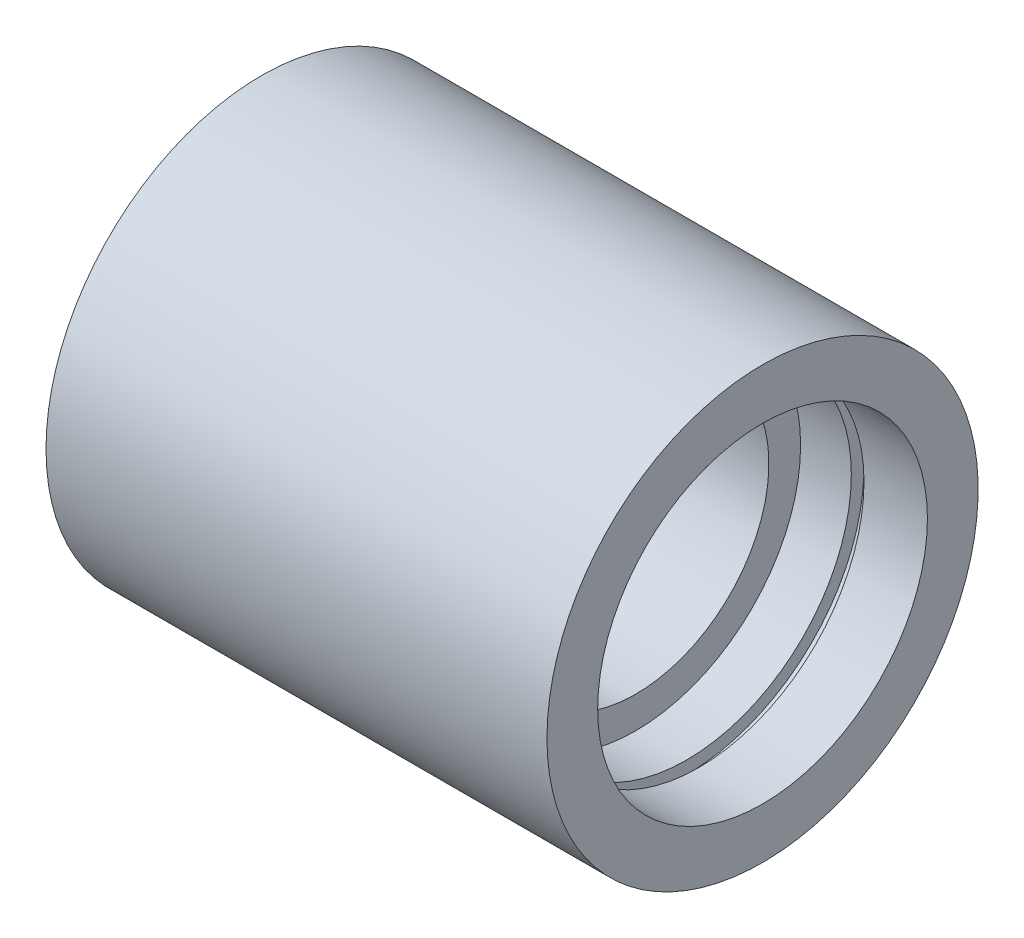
ISO-10303-21;
HEADER;
FILE_DESCRIPTION(('STEP AP214'),'2;1');
FILE_NAME('part.step','',(''),(''),'','','');
FILE_SCHEMA(('AUTOMOTIVE_DESIGN { 1 0 10303 214 1 1 1 1 }'));
ENDSEC;
DATA;
#1=APPLICATION_CONTEXT('core data for automotive mechanical design processes');
#2=APPLICATION_PROTOCOL_DEFINITION('international standard','automotive_design',2000,#1);
#3=PRODUCT_CONTEXT('',#1,'mechanical');
#4=PRODUCT('Part','Part','',(#3));
#5=PRODUCT_RELATED_PRODUCT_CATEGORY('part','',(#4));
#6=PRODUCT_DEFINITION_FORMATION('','',#4);
#7=PRODUCT_DEFINITION_CONTEXT('part definition',#1,'design');
#8=PRODUCT_DEFINITION('design','',#6,#7);
#9=PRODUCT_DEFINITION_SHAPE('','',#8);
#10=(LENGTH_UNIT() NAMED_UNIT(*) SI_UNIT(.MILLI.,.METRE.));
#11=(NAMED_UNIT(*) PLANE_ANGLE_UNIT() SI_UNIT($,.RADIAN.));
#12=(NAMED_UNIT(*) SI_UNIT($,.STERADIAN.) SOLID_ANGLE_UNIT());
#13=UNCERTAINTY_MEASURE_WITH_UNIT(LENGTH_MEASURE(1.E-05),#10,'distance_accuracy_value','');
#14=(GEOMETRIC_REPRESENTATION_CONTEXT(3) GLOBAL_UNCERTAINTY_ASSIGNED_CONTEXT((#13)) GLOBAL_UNIT_ASSIGNED_CONTEXT((#10,
#11,#12)) REPRESENTATION_CONTEXT('',''));
#15=CARTESIAN_POINT('',(0.,0.,0.));
#16=DIRECTION('',(0.,0.,1.));
#17=DIRECTION('',(1.,0.,0.));
#18=AXIS2_PLACEMENT_3D('',#15,#16,#17);
#19=CARTESIAN_POINT('',(0.,0.,0.));
#20=DIRECTION('',(-1.,0.,0.));
#21=DIRECTION('',(0.,0.,1.));
#22=AXIS2_PLACEMENT_3D('',#19,#20,#21);
#23=CYLINDRICAL_SURFACE('',#22,13.);
#24=CARTESIAN_POINT('',(10.,0.,0.));
#25=DIRECTION('',(-1.,0.,0.));
#26=DIRECTION('',(0.,0.,1.));
#27=AXIS2_PLACEMENT_3D('',#24,#25,#26);
#28=CIRCLE('',#27,13.);
#29=CARTESIAN_POINT('',(10.,0.,13.));
#30=VERTEX_POINT('',#29);
#31=EDGE_CURVE('E10',#30,#30,#28,.T.);
#32=ORIENTED_EDGE('',*,*,#31,.F.);
#33=EDGE_LOOP('',(#32));
#34=FACE_BOUND('',#33,.T.);
#35=CARTESIAN_POINT('',(0.,0.,0.));
#36=DIRECTION('',(-1.,0.,0.));
#37=DIRECTION('',(0.,0.,1.));
#38=AXIS2_PLACEMENT_3D('',#35,#36,#37);
#39=CIRCLE('',#38,13.);
#40=CARTESIAN_POINT('',(0.,0.,13.));
#41=VERTEX_POINT('',#40);
#42=EDGE_CURVE('E392',#41,#41,#39,.T.);
#43=ORIENTED_EDGE('',*,*,#42,.T.);
#44=EDGE_LOOP('',(#43));
#45=FACE_BOUND('',#44,.T.);
#46=ADVANCED_FACE('F346',(#34,#45),#23,.F.);
#47=CARTESIAN_POINT('',(10.,4.,0.));
#48=DIRECTION('',(1.,0.,0.));
#49=DIRECTION('',(0.,0.,-1.));
#50=AXIS2_PLACEMENT_3D('',#47,#48,#49);
#51=PLANE('',#50);
#52=CARTESIAN_POINT('',(10.,0.,0.));
#53=DIRECTION('',(-1.,0.,0.));
#54=DIRECTION('',(0.,0.,1.));
#55=AXIS2_PLACEMENT_3D('',#52,#53,#54);
#56=CIRCLE('',#55,4.);
#57=CARTESIAN_POINT('',(10.,0.,4.));
#58=VERTEX_POINT('',#57);
#59=EDGE_CURVE('E352',#58,#58,#56,.T.);
#60=ORIENTED_EDGE('',*,*,#59,.F.);
#61=EDGE_LOOP('',(#60));
#62=FACE_BOUND('',#61,.T.);
#63=ORIENTED_EDGE('',*,*,#31,.T.);
#64=EDGE_LOOP('',(#63));
#65=FACE_BOUND('',#64,.T.);
#66=ADVANCED_FACE('F465',(#62,#65),#51,.F.);
#67=CARTESIAN_POINT('',(0.,0.,0.));
#68=DIRECTION('',(-1.,0.,0.));
#69=DIRECTION('',(0.,0.,1.));
#70=AXIS2_PLACEMENT_3D('',#67,#68,#69);
#71=CYLINDRICAL_SURFACE('',#70,4.);
#72=CARTESIAN_POINT('',(15.,0.,0.));
#73=DIRECTION('',(-1.,0.,0.));
#74=DIRECTION('',(0.,0.,1.));
#75=AXIS2_PLACEMENT_3D('',#72,#73,#74);
#76=CIRCLE('',#75,4.);
#77=CARTESIAN_POINT('',(15.,0.,4.));
#78=VERTEX_POINT('',#77);
#79=EDGE_CURVE('E356',#78,#78,#76,.T.);
#80=ORIENTED_EDGE('',*,*,#79,.F.);
#81=EDGE_LOOP('',(#80));
#82=FACE_BOUND('',#81,.T.);
#83=ORIENTED_EDGE('',*,*,#59,.T.);
#84=EDGE_LOOP('',(#83));
#85=FACE_BOUND('',#84,.T.);
#86=ADVANCED_FACE('F460',(#82,#85),#71,.F.);
#87=CARTESIAN_POINT('',(15.,10.5,0.));
#88=DIRECTION('',(-1.,0.,0.));
#89=DIRECTION('',(0.,0.,1.));
#90=AXIS2_PLACEMENT_3D('',#87,#88,#89);
#91=PLANE('',#90);
#92=CARTESIAN_POINT('',(15.,0.,0.));
#93=DIRECTION('',(-1.,0.,0.));
#94=DIRECTION('',(0.,0.,1.));
#95=AXIS2_PLACEMENT_3D('',#92,#93,#94);
#96=CIRCLE('',#95,10.5);
#97=CARTESIAN_POINT('',(15.,0.,10.5));
#98=VERTEX_POINT('',#97);
#99=EDGE_CURVE('E360',#98,#98,#96,.T.);
#100=ORIENTED_EDGE('',*,*,#99,.F.);
#101=EDGE_LOOP('',(#100));
#102=FACE_BOUND('',#101,.T.);
#103=ORIENTED_EDGE('',*,*,#79,.T.);
#104=EDGE_LOOP('',(#103));
#105=FACE_BOUND('',#104,.T.);
#106=ADVANCED_FACE('F454',(#102,#105),#91,.F.);
#107=CARTESIAN_POINT('',(0.,0.,0.));
#108=DIRECTION('',(-1.,0.,0.));
#109=DIRECTION('',(0.,0.,1.));
#110=AXIS2_PLACEMENT_3D('',#107,#108,#109);
#111=CYLINDRICAL_SURFACE('',#110,10.5);
#112=CARTESIAN_POINT('',(29.5,0.,0.));
#113=DIRECTION('',(-1.,0.,0.));
#114=DIRECTION('',(0.,0.,1.));
#115=AXIS2_PLACEMENT_3D('',#112,#113,#114);
#116=CIRCLE('',#115,10.5);
#117=CARTESIAN_POINT('',(29.5,0.,10.5));
#118=VERTEX_POINT('',#117);
#119=EDGE_CURVE('E365',#118,#118,#116,.T.);
#120=ORIENTED_EDGE('',*,*,#119,.F.);
#121=EDGE_LOOP('',(#120));
#122=FACE_BOUND('',#121,.T.);
#123=ORIENTED_EDGE('',*,*,#99,.T.);
#124=EDGE_LOOP('',(#123));
#125=FACE_BOUND('',#124,.T.);
#126=ADVANCED_FACE('F448',(#122,#125),#111,.F.);
#127=CARTESIAN_POINT('',(29.5,13.,0.));
#128=DIRECTION('',(-1.,0.,0.));
#129=DIRECTION('',(0.,0.,1.));
#130=AXIS2_PLACEMENT_3D('',#127,#128,#129);
#131=PLANE('',#130);
#132=CARTESIAN_POINT('',(29.5,0.,0.));
#133=DIRECTION('',(-1.,0.,0.));
#134=DIRECTION('',(0.,0.,1.));
#135=AXIS2_PLACEMENT_3D('',#132,#133,#134);
#136=CIRCLE('',#135,13.);
#137=CARTESIAN_POINT('',(29.5,0.,13.));
#138=VERTEX_POINT('',#137);
#139=EDGE_CURVE('E368',#138,#138,#136,.T.);
#140=ORIENTED_EDGE('',*,*,#139,.F.);
#141=EDGE_LOOP('',(#140));
#142=FACE_BOUND('',#141,.T.);
#143=ORIENTED_EDGE('',*,*,#119,.T.);
#144=EDGE_LOOP('',(#143));
#145=FACE_BOUND('',#144,.T.);
#146=ADVANCED_FACE('F442',(#142,#145),#131,.F.);
#147=CARTESIAN_POINT('',(0.,0.,0.));
#148=DIRECTION('',(-1.,0.,0.));
#149=DIRECTION('',(0.,0.,1.));
#150=AXIS2_PLACEMENT_3D('',#147,#148,#149);
#151=CYLINDRICAL_SURFACE('',#150,13.);
#152=CARTESIAN_POINT('',(33.5,0.,0.));
#153=DIRECTION('',(-1.,0.,0.));
#154=DIRECTION('',(0.,0.,1.));
#155=AXIS2_PLACEMENT_3D('',#152,#153,#154);
#156=CIRCLE('',#155,13.);
#157=CARTESIAN_POINT('',(33.5,0.,13.));
#158=VERTEX_POINT('',#157);
#159=EDGE_CURVE('E371',#158,#158,#156,.T.);
#160=ORIENTED_EDGE('',*,*,#159,.F.);
#161=EDGE_LOOP('',(#160));
#162=FACE_BOUND('',#161,.T.);
#163=ORIENTED_EDGE('',*,*,#139,.T.);
#164=EDGE_LOOP('',(#163));
#165=FACE_BOUND('',#164,.T.);
#166=ADVANCED_FACE('F436',(#162,#165),#151,.F.);
#167=CARTESIAN_POINT('',(33.5,14.,0.));
#168=DIRECTION('',(-1.,0.,0.));
#169=DIRECTION('',(0.,0.,1.));
#170=AXIS2_PLACEMENT_3D('',#167,#168,#169);
#171=PLANE('',#170);
#172=CARTESIAN_POINT('',(33.5,0.,0.));
#173=DIRECTION('',(-1.,0.,0.));
#174=DIRECTION('',(0.,0.,1.));
#175=AXIS2_PLACEMENT_3D('',#172,#173,#174);
#176=CIRCLE('',#175,14.);
#177=CARTESIAN_POINT('',(33.5,0.,14.));
#178=VERTEX_POINT('',#177);
#179=EDGE_CURVE('E374',#178,#178,#176,.T.);
#180=ORIENTED_EDGE('',*,*,#179,.F.);
#181=EDGE_LOOP('',(#180));
#182=FACE_BOUND('',#181,.T.);
#183=ORIENTED_EDGE('',*,*,#159,.T.);
#184=EDGE_LOOP('',(#183));
#185=FACE_BOUND('',#184,.T.);
#186=ADVANCED_FACE('F430',(#182,#185),#171,.F.);
#187=CARTESIAN_POINT('',(0.,0.,0.));
#188=DIRECTION('',(-1.,0.,0.));
#189=DIRECTION('',(0.,0.,1.));
#190=AXIS2_PLACEMENT_3D('',#187,#188,#189);
#191=CYLINDRICAL_SURFACE('',#190,14.);
#192=CARTESIAN_POINT('',(34.5,0.,0.));
#193=DIRECTION('',(-1.,0.,0.));
#194=DIRECTION('',(0.,0.,1.));
#195=AXIS2_PLACEMENT_3D('',#192,#193,#194);
#196=CIRCLE('',#195,14.);
#197=CARTESIAN_POINT('',(34.5,0.,14.));
#198=VERTEX_POINT('',#197);
#199=EDGE_CURVE('E377',#198,#198,#196,.T.);
#200=ORIENTED_EDGE('',*,*,#199,.F.);
#201=EDGE_LOOP('',(#200));
#202=FACE_BOUND('',#201,.T.);
#203=ORIENTED_EDGE('',*,*,#179,.T.);
#204=EDGE_LOOP('',(#203));
#205=FACE_BOUND('',#204,.T.);
#206=ADVANCED_FACE('F424',(#202,#205),#191,.F.);
#207=CARTESIAN_POINT('',(34.5,13.,0.));
#208=DIRECTION('',(1.,0.,0.));
#209=DIRECTION('',(0.,0.,-1.));
#210=AXIS2_PLACEMENT_3D('',#207,#208,#209);
#211=PLANE('',#210);
#212=CARTESIAN_POINT('',(34.5,0.,0.));
#213=DIRECTION('',(-1.,0.,0.));
#214=DIRECTION('',(0.,0.,1.));
#215=AXIS2_PLACEMENT_3D('',#212,#213,#214);
#216=CIRCLE('',#215,13.);
#217=CARTESIAN_POINT('',(34.5,0.,13.));
#218=VERTEX_POINT('',#217);
#219=EDGE_CURVE('E380',#218,#218,#216,.T.);
#220=ORIENTED_EDGE('',*,*,#219,.F.);
#221=EDGE_LOOP('',(#220));
#222=FACE_BOUND('',#221,.T.);
#223=ORIENTED_EDGE('',*,*,#199,.T.);
#224=EDGE_LOOP('',(#223));
#225=FACE_BOUND('',#224,.T.);
#226=ADVANCED_FACE('F418',(#222,#225),#211,.F.);
#227=CARTESIAN_POINT('',(0.,0.,0.));
#228=DIRECTION('',(-1.,0.,0.));
#229=DIRECTION('',(0.,0.,1.));
#230=AXIS2_PLACEMENT_3D('',#227,#228,#229);
#231=CYLINDRICAL_SURFACE('',#230,13.);
#232=CARTESIAN_POINT('',(39.5,0.,0.));
#233=DIRECTION('',(-1.,0.,0.));
#234=DIRECTION('',(0.,0.,1.));
#235=AXIS2_PLACEMENT_3D('',#232,#233,#234);
#236=CIRCLE('',#235,13.);
#237=CARTESIAN_POINT('',(39.5,0.,13.));
#238=VERTEX_POINT('',#237);
#239=EDGE_CURVE('E383',#238,#238,#236,.T.);
#240=ORIENTED_EDGE('',*,*,#239,.F.);
#241=EDGE_LOOP('',(#240));
#242=FACE_BOUND('',#241,.T.);
#243=ORIENTED_EDGE('',*,*,#219,.T.);
#244=EDGE_LOOP('',(#243));
#245=FACE_BOUND('',#244,.T.);
#246=ADVANCED_FACE('F412',(#242,#245),#231,.F.);
#247=CARTESIAN_POINT('',(39.5,17.,0.));
#248=DIRECTION('',(-1.,0.,0.));
#249=DIRECTION('',(0.,0.,1.));
#250=AXIS2_PLACEMENT_3D('',#247,#248,#249);
#251=PLANE('',#250);
#252=CARTESIAN_POINT('',(39.5,0.,0.));
#253=DIRECTION('',(-1.,0.,0.));
#254=DIRECTION('',(0.,0.,1.));
#255=AXIS2_PLACEMENT_3D('',#252,#253,#254);
#256=CIRCLE('',#255,17.);
#257=CARTESIAN_POINT('',(39.5,0.,17.));
#258=VERTEX_POINT('',#257);
#259=EDGE_CURVE('E386',#258,#258,#256,.T.);
#260=ORIENTED_EDGE('',*,*,#259,.F.);
#261=EDGE_LOOP('',(#260));
#262=FACE_BOUND('',#261,.T.);
#263=ORIENTED_EDGE('',*,*,#239,.T.);
#264=EDGE_LOOP('',(#263));
#265=FACE_BOUND('',#264,.T.);
#266=ADVANCED_FACE('F406',(#262,#265),#251,.F.);
#267=CARTESIAN_POINT('',(0.,0.,0.));
#268=DIRECTION('',(-1.,0.,0.));
#269=DIRECTION('',(0.,0.,1.));
#270=AXIS2_PLACEMENT_3D('',#267,#268,#269);
#271=CYLINDRICAL_SURFACE('',#270,17.);
#272=CARTESIAN_POINT('',(0.,0.,0.));
#273=DIRECTION('',(-1.,0.,0.));
#274=DIRECTION('',(0.,0.,1.));
#275=AXIS2_PLACEMENT_3D('',#272,#273,#274);
#276=CIRCLE('',#275,17.);
#277=CARTESIAN_POINT('',(0.,0.,17.));
#278=VERTEX_POINT('',#277);
#279=EDGE_CURVE('E389',#278,#278,#276,.T.);
#280=ORIENTED_EDGE('',*,*,#279,.F.);
#281=EDGE_LOOP('',(#280));
#282=FACE_BOUND('',#281,.T.);
#283=ORIENTED_EDGE('',*,*,#259,.T.);
#284=EDGE_LOOP('',(#283));
#285=FACE_BOUND('',#284,.T.);
#286=ADVANCED_FACE('F400',(#282,#285),#271,.T.);
#287=CARTESIAN_POINT('',(0.,13.,0.));
#288=DIRECTION('',(1.,0.,0.));
#289=DIRECTION('',(0.,0.,-1.));
#290=AXIS2_PLACEMENT_3D('',#287,#288,#289);
#291=PLANE('',#290);
#292=ORIENTED_EDGE('',*,*,#42,.F.);
#293=EDGE_LOOP('',(#292));
#294=FACE_BOUND('',#293,.T.);
#295=ORIENTED_EDGE('',*,*,#279,.T.);
#296=EDGE_LOOP('',(#295));
#297=FACE_BOUND('',#296,.T.);
#298=ADVANCED_FACE('F397',(#294,#297),#291,.F.);
#299=CLOSED_SHELL('',(#46,#66,#86,#106,#126,#146,#166,#186,#206,#226,#246,#266,#286,#298));
#300=MANIFOLD_SOLID_BREP('B2',#299);
#301=ADVANCED_BREP_SHAPE_REPRESENTATION('',(#18,#300),#14);
#302=SHAPE_DEFINITION_REPRESENTATION(#9,#301);
ENDSEC;
END-ISO-10303-21;
